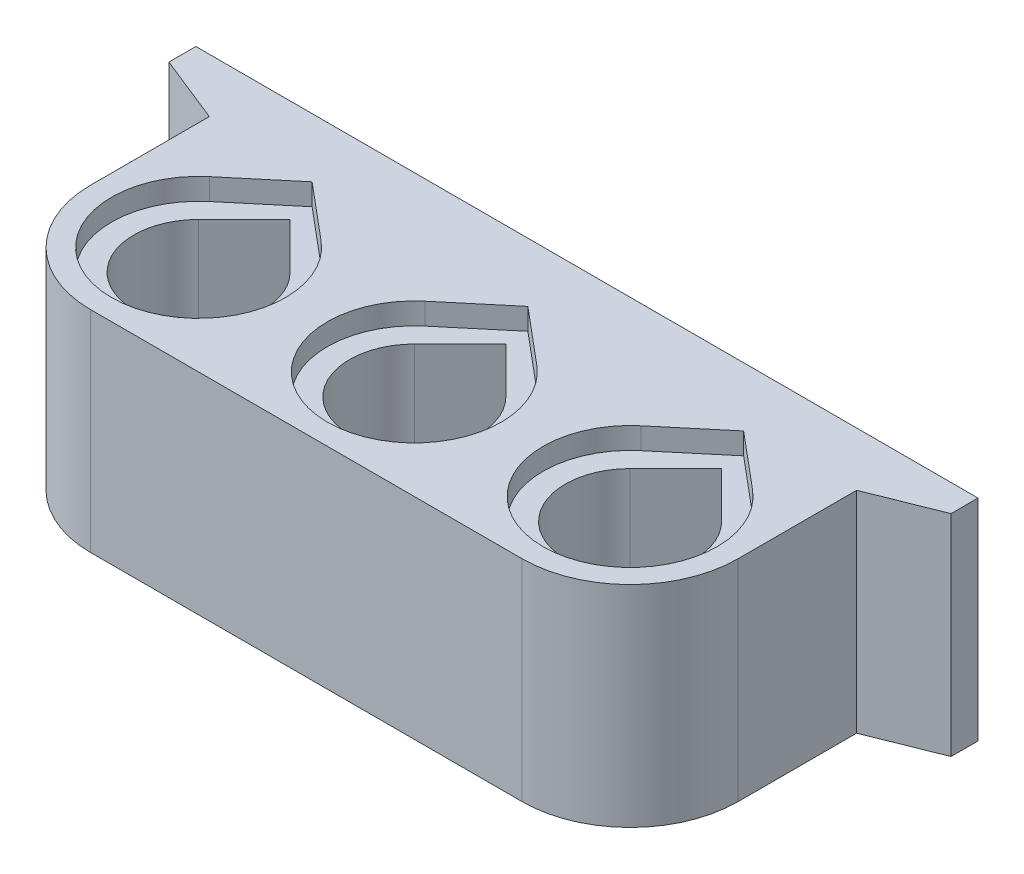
ISO-10303-21;
HEADER;
FILE_DESCRIPTION(('STEP AP214'),'2;1');
FILE_NAME('part.step','',(''),(''),'','','');
FILE_SCHEMA(('AUTOMOTIVE_DESIGN { 1 0 10303 214 1 1 1 1 }'));
ENDSEC;
DATA;
#1=APPLICATION_CONTEXT('core data for automotive mechanical design processes');
#2=APPLICATION_PROTOCOL_DEFINITION('international standard','automotive_design',2000,#1);
#3=PRODUCT_CONTEXT('',#1,'mechanical');
#4=PRODUCT('Part','Part','',(#3));
#5=PRODUCT_RELATED_PRODUCT_CATEGORY('part','',(#4));
#6=PRODUCT_DEFINITION_FORMATION('','',#4);
#7=PRODUCT_DEFINITION_CONTEXT('part definition',#1,'design');
#8=PRODUCT_DEFINITION('design','',#6,#7);
#9=PRODUCT_DEFINITION_SHAPE('','',#8);
#10=(LENGTH_UNIT() NAMED_UNIT(*) SI_UNIT(.MILLI.,.METRE.));
#11=(NAMED_UNIT(*) PLANE_ANGLE_UNIT() SI_UNIT($,.RADIAN.));
#12=(NAMED_UNIT(*) SI_UNIT($,.STERADIAN.) SOLID_ANGLE_UNIT());
#13=UNCERTAINTY_MEASURE_WITH_UNIT(LENGTH_MEASURE(1.E-05),#10,'distance_accuracy_value','');
#14=(GEOMETRIC_REPRESENTATION_CONTEXT(3) GLOBAL_UNCERTAINTY_ASSIGNED_CONTEXT((#13)) GLOBAL_UNIT_ASSIGNED_CONTEXT((#10,
#11,#12)) REPRESENTATION_CONTEXT('',''));
#15=CARTESIAN_POINT('',(0.,0.,0.));
#16=DIRECTION('',(0.,0.,1.));
#17=DIRECTION('',(1.,0.,0.));
#18=AXIS2_PLACEMENT_3D('',#15,#16,#17);
#19=CARTESIAN_POINT('',(4.,7.8,-7.39411254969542));
#20=DIRECTION('',(0.707106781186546,0.,0.707106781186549));
#21=DIRECTION('',(0.707106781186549,0.,-0.707106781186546));
#22=AXIS2_PLACEMENT_3D('',#19,#20,#21);
#23=PLANE('',#22);
#24=DIRECTION('',(0.,-1.,0.));
#25=VECTOR('',#24,1.);
#26=CARTESIAN_POINT('',(2.30294372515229,7.8,-5.69705627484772));
#27=LINE('',#26,#25);
#28=CARTESIAN_POINT('',(2.30294372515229,7.,-5.69705627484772));
#29=VERTEX_POINT('',#28);
#30=CARTESIAN_POINT('',(2.30294372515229,0.8,-5.69705627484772));
#31=VERTEX_POINT('',#30);
#32=EDGE_CURVE('E493',#29,#31,#27,.T.);
#33=ORIENTED_EDGE('',*,*,#32,.T.);
#34=DIRECTION('',(0.707106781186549,0.,-0.707106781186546));
#35=VECTOR('',#34,1.);
#36=CARTESIAN_POINT('',(4.,0.8,-7.39411254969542));
#37=LINE('',#36,#35);
#38=CARTESIAN_POINT('',(4.,0.8,-7.39411254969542));
#39=VERTEX_POINT('',#38);
#40=EDGE_CURVE('E376',#31,#39,#37,.T.);
#41=ORIENTED_EDGE('',*,*,#40,.T.);
#42=DIRECTION('',(0.,-1.,0.));
#43=VECTOR('',#42,1.);
#44=CARTESIAN_POINT('',(4.,7.8,-7.39411254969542));
#45=LINE('',#44,#43);
#46=CARTESIAN_POINT('',(4.,7.,-7.39411254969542));
#47=VERTEX_POINT('',#46);
#48=EDGE_CURVE('E487',#47,#39,#45,.T.);
#49=ORIENTED_EDGE('',*,*,#48,.F.);
#50=DIRECTION('',(-0.707106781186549,0.,0.707106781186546));
#51=VECTOR('',#50,1.);
#52=CARTESIAN_POINT('',(4.,7.,-7.39411254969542));
#53=LINE('',#52,#51);
#54=EDGE_CURVE('E466',#47,#29,#53,.T.);
#55=ORIENTED_EDGE('',*,*,#54,.T.);
#56=EDGE_LOOP('',(#33,#41,#49,#55));
#57=FACE_BOUND('',#56,.T.);
#58=ADVANCED_FACE('F37',(#57),#23,.T.);
#59=CARTESIAN_POINT('',(4.,7.8,-4.));
#60=DIRECTION('',(0.,-1.,0.));
#61=DIRECTION('',(0.,0.,-1.));
#62=AXIS2_PLACEMENT_3D('',#59,#60,#61);
#63=CYLINDRICAL_SURFACE('',#62,2.4);
#64=DIRECTION('',(0.,-1.,0.));
#65=VECTOR('',#64,1.);
#66=CARTESIAN_POINT('',(5.69705627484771,7.8,-5.69705627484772));
#67=LINE('',#66,#65);
#68=CARTESIAN_POINT('',(5.69705627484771,7.,-5.69705627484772));
#69=VERTEX_POINT('',#68);
#70=CARTESIAN_POINT('',(5.69705627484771,0.8,-5.69705627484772));
#71=VERTEX_POINT('',#70);
#72=EDGE_CURVE('E490',#69,#71,#67,.T.);
#73=ORIENTED_EDGE('',*,*,#72,.T.);
#74=CARTESIAN_POINT('',(4.,0.8,-4.));
#75=DIRECTION('',(0.,-1.,0.));
#76=DIRECTION('',(0.,0.,-1.));
#77=AXIS2_PLACEMENT_3D('',#74,#75,#76);
#78=CIRCLE('',#77,2.4);
#79=EDGE_CURVE('E373',#71,#31,#78,.T.);
#80=ORIENTED_EDGE('',*,*,#79,.T.);
#81=ORIENTED_EDGE('',*,*,#32,.F.);
#82=CARTESIAN_POINT('',(4.,7.,-4.));
#83=DIRECTION('',(0.,1.,0.));
#84=DIRECTION('',(0.,0.,1.));
#85=AXIS2_PLACEMENT_3D('',#82,#83,#84);
#86=CIRCLE('',#85,2.4);
#87=EDGE_CURVE('E463',#29,#69,#86,.T.);
#88=ORIENTED_EDGE('',*,*,#87,.T.);
#89=EDGE_LOOP('',(#73,#80,#81,#88));
#90=FACE_BOUND('',#89,.T.);
#91=ADVANCED_FACE('F625',(#90),#63,.F.);
#92=CARTESIAN_POINT('',(4.,7.8,-7.39411254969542));
#93=DIRECTION('',(-0.707106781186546,0.,0.707106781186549));
#94=DIRECTION('',(0.707106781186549,0.,0.707106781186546));
#95=AXIS2_PLACEMENT_3D('',#92,#93,#94);
#96=PLANE('',#95);
#97=ORIENTED_EDGE('',*,*,#48,.T.);
#98=DIRECTION('',(0.707106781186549,0.,0.707106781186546));
#99=VECTOR('',#98,1.);
#100=CARTESIAN_POINT('',(4.,0.8,-7.39411254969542));
#101=LINE('',#100,#99);
#102=EDGE_CURVE('E563',#39,#71,#101,.T.);
#103=ORIENTED_EDGE('',*,*,#102,.T.);
#104=ORIENTED_EDGE('',*,*,#72,.F.);
#105=DIRECTION('',(-0.707106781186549,0.,-0.707106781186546));
#106=VECTOR('',#105,1.);
#107=CARTESIAN_POINT('',(4.,7.,-7.39411254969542));
#108=LINE('',#107,#106);
#109=EDGE_CURVE('E554',#69,#47,#108,.T.);
#110=ORIENTED_EDGE('',*,*,#109,.T.);
#111=EDGE_LOOP('',(#97,#103,#104,#110));
#112=FACE_BOUND('',#111,.T.);
#113=ADVANCED_FACE('F631',(#112),#96,.T.);
#114=CARTESIAN_POINT('',(12.,7.8,-7.39411254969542));
#115=DIRECTION('',(0.707106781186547,0.,0.707106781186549));
#116=DIRECTION('',(0.707106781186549,0.,-0.707106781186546));
#117=AXIS2_PLACEMENT_3D('',#114,#115,#116);
#118=PLANE('',#117);
#119=DIRECTION('',(0.,-1.,0.));
#120=VECTOR('',#119,1.);
#121=CARTESIAN_POINT('',(10.3029437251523,7.8,-5.69705627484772));
#122=LINE('',#121,#120);
#123=CARTESIAN_POINT('',(10.3029437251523,7.,-5.69705627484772));
#124=VERTEX_POINT('',#123);
#125=CARTESIAN_POINT('',(10.3029437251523,0.8,-5.69705627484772));
#126=VERTEX_POINT('',#125);
#127=EDGE_CURVE('E484',#124,#126,#122,.T.);
#128=ORIENTED_EDGE('',*,*,#127,.T.);
#129=DIRECTION('',(0.707106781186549,0.,-0.707106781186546));
#130=VECTOR('',#129,1.);
#131=CARTESIAN_POINT('',(12.,0.8,-7.39411254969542));
#132=LINE('',#131,#130);
#133=CARTESIAN_POINT('',(12.,0.8,-7.39411254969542));
#134=VERTEX_POINT('',#133);
#135=EDGE_CURVE('E370',#126,#134,#132,.T.);
#136=ORIENTED_EDGE('',*,*,#135,.T.);
#137=DIRECTION('',(0.,-1.,0.));
#138=VECTOR('',#137,1.);
#139=CARTESIAN_POINT('',(12.,7.8,-7.39411254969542));
#140=LINE('',#139,#138);
#141=CARTESIAN_POINT('',(12.,7.,-7.39411254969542));
#142=VERTEX_POINT('',#141);
#143=EDGE_CURVE('E478',#142,#134,#140,.T.);
#144=ORIENTED_EDGE('',*,*,#143,.F.);
#145=DIRECTION('',(-0.707106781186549,0.,0.707106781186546));
#146=VECTOR('',#145,1.);
#147=CARTESIAN_POINT('',(12.,7.,-7.39411254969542));
#148=LINE('',#147,#146);
#149=EDGE_CURVE('E460',#142,#124,#148,.T.);
#150=ORIENTED_EDGE('',*,*,#149,.T.);
#151=EDGE_LOOP('',(#128,#136,#144,#150));
#152=FACE_BOUND('',#151,.T.);
#153=ADVANCED_FACE('F959',(#152),#118,.T.);
#154=CARTESIAN_POINT('',(12.,7.8,-4.));
#155=DIRECTION('',(0.,-1.,0.));
#156=DIRECTION('',(0.,0.,-1.));
#157=AXIS2_PLACEMENT_3D('',#154,#155,#156);
#158=CYLINDRICAL_SURFACE('',#157,2.4);
#159=DIRECTION('',(0.,-1.,0.));
#160=VECTOR('',#159,1.);
#161=CARTESIAN_POINT('',(13.6970562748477,7.8,-5.69705627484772));
#162=LINE('',#161,#160);
#163=CARTESIAN_POINT('',(13.6970562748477,7.,-5.69705627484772));
#164=VERTEX_POINT('',#163);
#165=CARTESIAN_POINT('',(13.6970562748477,0.8,-5.69705627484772));
#166=VERTEX_POINT('',#165);
#167=EDGE_CURVE('E481',#164,#166,#162,.T.);
#168=ORIENTED_EDGE('',*,*,#167,.T.);
#169=CARTESIAN_POINT('',(12.,0.8,-4.));
#170=DIRECTION('',(0.,-1.,0.));
#171=DIRECTION('',(0.,0.,-1.));
#172=AXIS2_PLACEMENT_3D('',#169,#170,#171);
#173=CIRCLE('',#172,2.4);
#174=EDGE_CURVE('E367',#166,#126,#173,.T.);
#175=ORIENTED_EDGE('',*,*,#174,.T.);
#176=ORIENTED_EDGE('',*,*,#127,.F.);
#177=CARTESIAN_POINT('',(12.,7.,-4.));
#178=DIRECTION('',(0.,1.,0.));
#179=DIRECTION('',(0.,0.,1.));
#180=AXIS2_PLACEMENT_3D('',#177,#178,#179);
#181=CIRCLE('',#180,2.4);
#182=EDGE_CURVE('E457',#124,#164,#181,.T.);
#183=ORIENTED_EDGE('',*,*,#182,.T.);
#184=EDGE_LOOP('',(#168,#175,#176,#183));
#185=FACE_BOUND('',#184,.T.);
#186=ADVANCED_FACE('F968',(#185),#158,.F.);
#187=CARTESIAN_POINT('',(12.,7.8,-7.39411254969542));
#188=DIRECTION('',(-0.707106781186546,0.,0.707106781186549));
#189=DIRECTION('',(0.707106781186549,0.,0.707106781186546));
#190=AXIS2_PLACEMENT_3D('',#187,#188,#189);
#191=PLANE('',#190);
#192=ORIENTED_EDGE('',*,*,#143,.T.);
#193=DIRECTION('',(0.707106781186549,0.,0.707106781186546));
#194=VECTOR('',#193,1.);
#195=CARTESIAN_POINT('',(12.,0.8,-7.39411254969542));
#196=LINE('',#195,#194);
#197=EDGE_CURVE('E560',#134,#166,#196,.T.);
#198=ORIENTED_EDGE('',*,*,#197,.T.);
#199=ORIENTED_EDGE('',*,*,#167,.F.);
#200=DIRECTION('',(-0.707106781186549,0.,-0.707106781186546));
#201=VECTOR('',#200,1.);
#202=CARTESIAN_POINT('',(12.,7.,-7.39411254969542));
#203=LINE('',#202,#201);
#204=EDGE_CURVE('E551',#164,#142,#203,.T.);
#205=ORIENTED_EDGE('',*,*,#204,.T.);
#206=EDGE_LOOP('',(#192,#198,#199,#205));
#207=FACE_BOUND('',#206,.T.);
#208=ADVANCED_FACE('F978',(#207),#191,.T.);
#209=CARTESIAN_POINT('',(20.,7.8,-7.39411254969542));
#210=DIRECTION('',(0.707106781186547,0.,0.707106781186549));
#211=DIRECTION('',(0.707106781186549,0.,-0.707106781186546));
#212=AXIS2_PLACEMENT_3D('',#209,#210,#211);
#213=PLANE('',#212);
#214=DIRECTION('',(0.,-1.,0.));
#215=VECTOR('',#214,1.);
#216=CARTESIAN_POINT('',(18.3029437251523,7.8,-5.69705627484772));
#217=LINE('',#216,#215);
#218=CARTESIAN_POINT('',(18.3029437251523,7.,-5.69705627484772));
#219=VERTEX_POINT('',#218);
#220=CARTESIAN_POINT('',(18.3029437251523,0.8,-5.69705627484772));
#221=VERTEX_POINT('',#220);
#222=EDGE_CURVE('E475',#219,#221,#217,.T.);
#223=ORIENTED_EDGE('',*,*,#222,.T.);
#224=DIRECTION('',(0.707106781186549,0.,-0.707106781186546));
#225=VECTOR('',#224,1.);
#226=CARTESIAN_POINT('',(20.,0.8,-7.39411254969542));
#227=LINE('',#226,#225);
#228=CARTESIAN_POINT('',(20.,0.8,-7.39411254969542));
#229=VERTEX_POINT('',#228);
#230=EDGE_CURVE('E364',#221,#229,#227,.T.);
#231=ORIENTED_EDGE('',*,*,#230,.T.);
#232=DIRECTION('',(0.,-1.,0.));
#233=VECTOR('',#232,1.);
#234=CARTESIAN_POINT('',(20.,7.8,-7.39411254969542));
#235=LINE('',#234,#233);
#236=CARTESIAN_POINT('',(20.,7.,-7.39411254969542));
#237=VERTEX_POINT('',#236);
#238=EDGE_CURVE('E469',#237,#229,#235,.T.);
#239=ORIENTED_EDGE('',*,*,#238,.F.);
#240=DIRECTION('',(-0.707106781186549,0.,0.707106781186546));
#241=VECTOR('',#240,1.);
#242=CARTESIAN_POINT('',(20.,7.,-7.39411254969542));
#243=LINE('',#242,#241);
#244=EDGE_CURVE('E454',#237,#219,#243,.T.);
#245=ORIENTED_EDGE('',*,*,#244,.T.);
#246=EDGE_LOOP('',(#223,#231,#239,#245));
#247=FACE_BOUND('',#246,.T.);
#248=ADVANCED_FACE('F988',(#247),#213,.T.);
#249=CARTESIAN_POINT('',(20.,7.8,-4.));
#250=DIRECTION('',(0.,-1.,0.));
#251=DIRECTION('',(0.,0.,-1.));
#252=AXIS2_PLACEMENT_3D('',#249,#250,#251);
#253=CYLINDRICAL_SURFACE('',#252,2.4);
#254=DIRECTION('',(0.,-1.,0.));
#255=VECTOR('',#254,1.);
#256=CARTESIAN_POINT('',(21.6970562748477,7.8,-5.69705627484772));
#257=LINE('',#256,#255);
#258=CARTESIAN_POINT('',(21.6970562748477,7.,-5.69705627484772));
#259=VERTEX_POINT('',#258);
#260=CARTESIAN_POINT('',(21.6970562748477,0.8,-5.69705627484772));
#261=VERTEX_POINT('',#260);
#262=EDGE_CURVE('E472',#259,#261,#257,.T.);
#263=ORIENTED_EDGE('',*,*,#262,.T.);
#264=CARTESIAN_POINT('',(20.,0.8,-4.));
#265=DIRECTION('',(0.,-1.,0.));
#266=DIRECTION('',(0.,0.,-1.));
#267=AXIS2_PLACEMENT_3D('',#264,#265,#266);
#268=CIRCLE('',#267,2.4);
#269=EDGE_CURVE('E313',#261,#221,#268,.T.);
#270=ORIENTED_EDGE('',*,*,#269,.T.);
#271=ORIENTED_EDGE('',*,*,#222,.F.);
#272=CARTESIAN_POINT('',(20.,7.,-4.));
#273=DIRECTION('',(0.,1.,0.));
#274=DIRECTION('',(0.,0.,1.));
#275=AXIS2_PLACEMENT_3D('',#272,#273,#274);
#276=CIRCLE('',#275,2.4);
#277=EDGE_CURVE('E401',#219,#259,#276,.T.);
#278=ORIENTED_EDGE('',*,*,#277,.T.);
#279=EDGE_LOOP('',(#263,#270,#271,#278));
#280=FACE_BOUND('',#279,.T.);
#281=ADVANCED_FACE('F998',(#280),#253,.F.);
#282=CARTESIAN_POINT('',(20.,7.8,-7.39411254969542));
#283=DIRECTION('',(-0.707106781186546,0.,0.707106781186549));
#284=DIRECTION('',(0.707106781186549,0.,0.707106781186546));
#285=AXIS2_PLACEMENT_3D('',#282,#283,#284);
#286=PLANE('',#285);
#287=ORIENTED_EDGE('',*,*,#238,.T.);
#288=DIRECTION('',(0.707106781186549,0.,0.707106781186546));
#289=VECTOR('',#288,1.);
#290=CARTESIAN_POINT('',(20.,0.8,-7.39411254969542));
#291=LINE('',#290,#289);
#292=EDGE_CURVE('E557',#229,#261,#291,.T.);
#293=ORIENTED_EDGE('',*,*,#292,.T.);
#294=ORIENTED_EDGE('',*,*,#262,.F.);
#295=DIRECTION('',(-0.707106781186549,0.,-0.707106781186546));
#296=VECTOR('',#295,1.);
#297=CARTESIAN_POINT('',(20.,7.,-7.39411254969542));
#298=LINE('',#297,#296);
#299=EDGE_CURVE('E548',#259,#237,#298,.T.);
#300=ORIENTED_EDGE('',*,*,#299,.T.);
#301=EDGE_LOOP('',(#287,#293,#294,#300));
#302=FACE_BOUND('',#301,.T.);
#303=ADVANCED_FACE('F638',(#302),#286,.T.);
#304=CARTESIAN_POINT('',(0.,7.8,0.));
#305=DIRECTION('',(0.,1.,0.));
#306=DIRECTION('',(0.,0.,1.));
#307=AXIS2_PLACEMENT_3D('',#304,#305,#306);
#308=PLANE('',#307);
#309=DIRECTION('',(-0.766044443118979,0.,-0.642787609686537));
#310=VECTOR('',#309,1.);
#311=CARTESIAN_POINT('',(4.,7.8,-8.20993850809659));
#312=LINE('',#311,#310);
#313=CARTESIAN_POINT('',(6.07299004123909,7.8,-6.47049332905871));
#314=VERTEX_POINT('',#313);
#315=CARTESIAN_POINT('',(4.,7.8,-8.20993850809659));
#316=VERTEX_POINT('',#315);
#317=EDGE_CURVE('E391',#314,#316,#312,.T.);
#318=ORIENTED_EDGE('',*,*,#317,.F.);
#319=CARTESIAN_POINT('',(4.,7.8,-4.));
#320=DIRECTION('',(0.,1.,0.));
#321=DIRECTION('',(0.,0.,1.));
#322=AXIS2_PLACEMENT_3D('',#319,#320,#321);
#323=CIRCLE('',#322,3.225);
#324=CARTESIAN_POINT('',(1.92700995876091,7.8,-6.47049332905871));
#325=VERTEX_POINT('',#324);
#326=EDGE_CURVE('E384',#325,#314,#323,.T.);
#327=ORIENTED_EDGE('',*,*,#326,.F.);
#328=DIRECTION('',(-0.76604444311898,0.,0.642787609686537));
#329=VECTOR('',#328,1.);
#330=CARTESIAN_POINT('',(4.,7.8,-8.20993850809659));
#331=LINE('',#330,#329);
#332=EDGE_CURVE('E393',#316,#325,#331,.T.);
#333=ORIENTED_EDGE('',*,*,#332,.F.);
#334=EDGE_LOOP('',(#318,#327,#333));
#335=FACE_BOUND('',#334,.T.);
#336=DIRECTION('',(-0.766044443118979,0.,-0.642787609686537));
#337=VECTOR('',#336,1.);
#338=CARTESIAN_POINT('',(12.,7.8,-8.20993850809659));
#339=LINE('',#338,#337);
#340=CARTESIAN_POINT('',(14.0729900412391,7.8,-6.47049332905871));
#341=VERTEX_POINT('',#340);
#342=CARTESIAN_POINT('',(12.,7.8,-8.20993850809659));
#343=VERTEX_POINT('',#342);
#344=EDGE_CURVE('E394',#341,#343,#339,.T.);
#345=ORIENTED_EDGE('',*,*,#344,.F.);
#346=CARTESIAN_POINT('',(12.,7.8,-4.));
#347=DIRECTION('',(0.,1.,0.));
#348=DIRECTION('',(0.,0.,1.));
#349=AXIS2_PLACEMENT_3D('',#346,#347,#348);
#350=CIRCLE('',#349,3.225);
#351=CARTESIAN_POINT('',(9.92700995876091,7.8,-6.47049332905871));
#352=VERTEX_POINT('',#351);
#353=EDGE_CURVE('E415',#352,#341,#350,.T.);
#354=ORIENTED_EDGE('',*,*,#353,.F.);
#355=DIRECTION('',(-0.76604444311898,0.,0.642787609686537));
#356=VECTOR('',#355,1.);
#357=CARTESIAN_POINT('',(12.,7.8,-8.20993850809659));
#358=LINE('',#357,#356);
#359=EDGE_CURVE('E418',#343,#352,#358,.T.);
#360=ORIENTED_EDGE('',*,*,#359,.F.);
#361=EDGE_LOOP('',(#345,#354,#360));
#362=FACE_BOUND('',#361,.T.);
#363=DIRECTION('',(-0.766044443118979,0.,-0.642787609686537));
#364=VECTOR('',#363,1.);
#365=CARTESIAN_POINT('',(20.,7.8,-8.20993850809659));
#366=LINE('',#365,#364);
#367=CARTESIAN_POINT('',(22.0729900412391,7.8,-6.47049332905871));
#368=VERTEX_POINT('',#367);
#369=CARTESIAN_POINT('',(20.,7.8,-8.2099385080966));
#370=VERTEX_POINT('',#369);
#371=EDGE_CURVE('E414',#368,#370,#366,.T.);
#372=ORIENTED_EDGE('',*,*,#371,.F.);
#373=CARTESIAN_POINT('',(20.,7.8,-4.));
#374=DIRECTION('',(0.,1.,0.));
#375=DIRECTION('',(0.,0.,1.));
#376=AXIS2_PLACEMENT_3D('',#373,#374,#375);
#377=CIRCLE('',#376,3.225);
#378=CARTESIAN_POINT('',(17.9270099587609,7.8,-6.47049332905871));
#379=VERTEX_POINT('',#378);
#380=EDGE_CURVE('E437',#379,#368,#377,.T.);
#381=ORIENTED_EDGE('',*,*,#380,.F.);
#382=DIRECTION('',(-0.76604444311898,0.,0.642787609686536));
#383=VECTOR('',#382,1.);
#384=CARTESIAN_POINT('',(20.,7.8,-8.20993850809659));
#385=LINE('',#384,#383);
#386=EDGE_CURVE('E440',#370,#379,#385,.T.);
#387=ORIENTED_EDGE('',*,*,#386,.F.);
#388=EDGE_LOOP('',(#372,#381,#387));
#389=FACE_BOUND('',#388,.T.);
#390=DIRECTION('',(0.,0.,1.));
#391=VECTOR('',#390,1.);
#392=CARTESIAN_POINT('',(0.,7.8,0.));
#393=LINE('',#392,#391);
#394=CARTESIAN_POINT('',(0.,7.8,-8.4));
#395=VERTEX_POINT('',#394);
#396=CARTESIAN_POINT('',(0.,7.8,-4.));
#397=VERTEX_POINT('',#396);
#398=EDGE_CURVE('E497',#395,#397,#393,.T.);
#399=ORIENTED_EDGE('',*,*,#398,.T.);
#400=CARTESIAN_POINT('',(4.,7.8,-4.));
#401=DIRECTION('',(0.,1.,0.));
#402=DIRECTION('',(0.,0.,1.));
#403=AXIS2_PLACEMENT_3D('',#400,#401,#402);
#404=CIRCLE('',#403,4.);
#405=CARTESIAN_POINT('',(4.,7.8,0.));
#406=VERTEX_POINT('',#405);
#407=EDGE_CURVE('E45',#397,#406,#404,.T.);
#408=ORIENTED_EDGE('',*,*,#407,.T.);
#409=DIRECTION('',(1.,0.,0.));
#410=VECTOR('',#409,1.);
#411=CARTESIAN_POINT('',(0.,7.8,0.));
#412=LINE('',#411,#410);
#413=CARTESIAN_POINT('',(20.,7.8,0.));
#414=VERTEX_POINT('',#413);
#415=EDGE_CURVE('E499',#406,#414,#412,.T.);
#416=ORIENTED_EDGE('',*,*,#415,.T.);
#417=CARTESIAN_POINT('',(20.,7.8,-4.));
#418=DIRECTION('',(0.,1.,0.));
#419=DIRECTION('',(0.,0.,1.));
#420=AXIS2_PLACEMENT_3D('',#417,#418,#419);
#421=CIRCLE('',#420,4.);
#422=CARTESIAN_POINT('',(24.,7.8,-4.));
#423=VERTEX_POINT('',#422);
#424=EDGE_CURVE('E52',#414,#423,#421,.T.);
#425=ORIENTED_EDGE('',*,*,#424,.T.);
#426=DIRECTION('',(0.,0.,-1.));
#427=VECTOR('',#426,1.);
#428=CARTESIAN_POINT('',(24.,7.8,0.));
#429=LINE('',#428,#427);
#430=CARTESIAN_POINT('',(24.,7.8,-8.4));
#431=VERTEX_POINT('',#430);
#432=EDGE_CURVE('E502',#423,#431,#429,.T.);
#433=ORIENTED_EDGE('',*,*,#432,.T.);
#434=DIRECTION('',(0.92847669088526,0.,-0.371390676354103));
#435=VECTOR('',#434,1.);
#436=CARTESIAN_POINT('',(26.5,7.8,-9.4));
#437=LINE('',#436,#435);
#438=CARTESIAN_POINT('',(26.5,7.8,-9.4));
#439=VERTEX_POINT('',#438);
#440=EDGE_CURVE('E504',#431,#439,#437,.T.);
#441=ORIENTED_EDGE('',*,*,#440,.T.);
#442=DIRECTION('',(0.,0.,-1.));
#443=VECTOR('',#442,1.);
#444=CARTESIAN_POINT('',(26.5,7.8,-10.4));
#445=LINE('',#444,#443);
#446=CARTESIAN_POINT('',(26.5,7.8,-10.4));
#447=VERTEX_POINT('',#446);
#448=EDGE_CURVE('E506',#439,#447,#445,.T.);
#449=ORIENTED_EDGE('',*,*,#448,.T.);
#450=DIRECTION('',(-1.,0.,0.));
#451=VECTOR('',#450,1.);
#452=CARTESIAN_POINT('',(24.,7.8,-10.4));
#453=LINE('',#452,#451);
#454=CARTESIAN_POINT('',(-2.5,7.8,-10.4));
#455=VERTEX_POINT('',#454);
#456=EDGE_CURVE('E508',#447,#455,#453,.T.);
#457=ORIENTED_EDGE('',*,*,#456,.T.);
#458=DIRECTION('',(0.,0.,1.));
#459=VECTOR('',#458,1.);
#460=CARTESIAN_POINT('',(-2.5,7.8,-10.4));
#461=LINE('',#460,#459);
#462=CARTESIAN_POINT('',(-2.5,7.8,-9.4));
#463=VERTEX_POINT('',#462);
#464=EDGE_CURVE('E510',#455,#463,#461,.T.);
#465=ORIENTED_EDGE('',*,*,#464,.T.);
#466=DIRECTION('',(0.928476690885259,0.,0.371390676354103));
#467=VECTOR('',#466,1.);
#468=CARTESIAN_POINT('',(-2.5,7.8,-9.4));
#469=LINE('',#468,#467);
#470=EDGE_CURVE('E512',#463,#395,#469,.T.);
#471=ORIENTED_EDGE('',*,*,#470,.T.);
#472=EDGE_LOOP('',(#399,#408,#416,#425,#433,#441,#449,#457,#465,#471));
#473=FACE_BOUND('',#472,.T.);
#474=ADVANCED_FACE('F578',(#335,#362,#389,#473),#308,.T.);
#475=CARTESIAN_POINT('',(0.,0.,0.));
#476=DIRECTION('',(0.,1.,0.));
#477=DIRECTION('',(0.,0.,1.));
#478=AXIS2_PLACEMENT_3D('',#475,#476,#477);
#479=PLANE('',#478);
#480=DIRECTION('',(-0.766044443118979,0.,-0.642787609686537));
#481=VECTOR('',#480,1.);
#482=CARTESIAN_POINT('',(4.,0.,-8.20993850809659));
#483=LINE('',#482,#481);
#484=CARTESIAN_POINT('',(6.07299004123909,0.,-6.47049332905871));
#485=VERTEX_POINT('',#484);
#486=CARTESIAN_POINT('',(4.,0.,-8.20993850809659));
#487=VERTEX_POINT('',#486);
#488=EDGE_CURVE('E298',#485,#487,#483,.T.);
#489=ORIENTED_EDGE('',*,*,#488,.T.);
#490=DIRECTION('',(-0.76604444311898,0.,0.642787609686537));
#491=VECTOR('',#490,1.);
#492=CARTESIAN_POINT('',(4.,0.,-8.20993850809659));
#493=LINE('',#492,#491);
#494=CARTESIAN_POINT('',(1.92700995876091,0.,-6.47049332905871));
#495=VERTEX_POINT('',#494);
#496=EDGE_CURVE('E301',#487,#495,#493,.T.);
#497=ORIENTED_EDGE('',*,*,#496,.T.);
#498=CARTESIAN_POINT('',(4.,0.,-4.));
#499=DIRECTION('',(0.,1.,0.));
#500=DIRECTION('',(0.,0.,1.));
#501=AXIS2_PLACEMENT_3D('',#498,#499,#500);
#502=CIRCLE('',#501,3.225);
#503=EDGE_CURVE('E304',#495,#485,#502,.T.);
#504=ORIENTED_EDGE('',*,*,#503,.T.);
#505=EDGE_LOOP('',(#489,#497,#504));
#506=FACE_BOUND('',#505,.T.);
#507=DIRECTION('',(-0.766044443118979,0.,-0.642787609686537));
#508=VECTOR('',#507,1.);
#509=CARTESIAN_POINT('',(12.,0.,-8.20993850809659));
#510=LINE('',#509,#508);
#511=CARTESIAN_POINT('',(14.0729900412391,0.,-6.47049332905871));
#512=VERTEX_POINT('',#511);
#513=CARTESIAN_POINT('',(12.,0.,-8.20993850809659));
#514=VERTEX_POINT('',#513);
#515=EDGE_CURVE('E324',#512,#514,#510,.T.);
#516=ORIENTED_EDGE('',*,*,#515,.T.);
#517=DIRECTION('',(-0.76604444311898,0.,0.642787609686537));
#518=VECTOR('',#517,1.);
#519=CARTESIAN_POINT('',(12.,0.,-8.20993850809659));
#520=LINE('',#519,#518);
#521=CARTESIAN_POINT('',(9.92700995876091,0.,-6.47049332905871));
#522=VERTEX_POINT('',#521);
#523=EDGE_CURVE('E319',#514,#522,#520,.T.);
#524=ORIENTED_EDGE('',*,*,#523,.T.);
#525=CARTESIAN_POINT('',(12.,0.,-4.));
#526=DIRECTION('',(0.,1.,0.));
#527=DIRECTION('',(0.,0.,1.));
#528=AXIS2_PLACEMENT_3D('',#525,#526,#527);
#529=CIRCLE('',#528,3.225);
#530=EDGE_CURVE('E327',#522,#512,#529,.T.);
#531=ORIENTED_EDGE('',*,*,#530,.T.);
#532=EDGE_LOOP('',(#516,#524,#531));
#533=FACE_BOUND('',#532,.T.);
#534=DIRECTION('',(-0.766044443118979,0.,-0.642787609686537));
#535=VECTOR('',#534,1.);
#536=CARTESIAN_POINT('',(20.,0.,-8.20993850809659));
#537=LINE('',#536,#535);
#538=CARTESIAN_POINT('',(22.0729900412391,0.,-6.47049332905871));
#539=VERTEX_POINT('',#538);
#540=CARTESIAN_POINT('',(20.,0.,-8.20993850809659));
#541=VERTEX_POINT('',#540);
#542=EDGE_CURVE('E348',#539,#541,#537,.T.);
#543=ORIENTED_EDGE('',*,*,#542,.T.);
#544=DIRECTION('',(-0.76604444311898,0.,0.642787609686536));
#545=VECTOR('',#544,1.);
#546=CARTESIAN_POINT('',(20.,0.,-8.20993850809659));
#547=LINE('',#546,#545);
#548=CARTESIAN_POINT('',(17.9270099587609,0.,-6.47049332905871));
#549=VERTEX_POINT('',#548);
#550=EDGE_CURVE('E343',#541,#549,#547,.T.);
#551=ORIENTED_EDGE('',*,*,#550,.T.);
#552=CARTESIAN_POINT('',(20.,0.,-4.));
#553=DIRECTION('',(0.,1.,0.));
#554=DIRECTION('',(0.,0.,1.));
#555=AXIS2_PLACEMENT_3D('',#552,#553,#554);
#556=CIRCLE('',#555,3.225);
#557=EDGE_CURVE('E351',#549,#539,#556,.T.);
#558=ORIENTED_EDGE('',*,*,#557,.T.);
#559=EDGE_LOOP('',(#543,#551,#558));
#560=FACE_BOUND('',#559,.T.);
#561=DIRECTION('',(1.,0.,0.));
#562=VECTOR('',#561,1.);
#563=CARTESIAN_POINT('',(0.,0.,0.));
#564=LINE('',#563,#562);
#565=CARTESIAN_POINT('',(4.,0.,0.));
#566=VERTEX_POINT('',#565);
#567=CARTESIAN_POINT('',(20.,0.,0.));
#568=VERTEX_POINT('',#567);
#569=EDGE_CURVE('E516',#566,#568,#564,.T.);
#570=ORIENTED_EDGE('',*,*,#569,.F.);
#571=CARTESIAN_POINT('',(4.,0.,-4.));
#572=DIRECTION('',(0.,1.,0.));
#573=DIRECTION('',(0.,0.,1.));
#574=AXIS2_PLACEMENT_3D('',#571,#572,#573);
#575=CIRCLE('',#574,4.);
#576=CARTESIAN_POINT('',(0.,0.,-4.));
#577=VERTEX_POINT('',#576);
#578=EDGE_CURVE('E573',#566,#577,#575,.F.);
#579=ORIENTED_EDGE('',*,*,#578,.T.);
#580=DIRECTION('',(0.,0.,1.));
#581=VECTOR('',#580,1.);
#582=CARTESIAN_POINT('',(0.,0.,0.));
#583=LINE('',#582,#581);
#584=CARTESIAN_POINT('',(0.,0.,-8.4));
#585=VERTEX_POINT('',#584);
#586=EDGE_CURVE('E496',#585,#577,#583,.T.);
#587=ORIENTED_EDGE('',*,*,#586,.F.);
#588=DIRECTION('',(0.928476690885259,0.,0.371390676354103));
#589=VECTOR('',#588,1.);
#590=CARTESIAN_POINT('',(-2.5,0.,-9.4));
#591=LINE('',#590,#589);
#592=CARTESIAN_POINT('',(-2.5,0.,-9.4));
#593=VERTEX_POINT('',#592);
#594=EDGE_CURVE('E500',#593,#585,#591,.T.);
#595=ORIENTED_EDGE('',*,*,#594,.F.);
#596=DIRECTION('',(0.,0.,1.));
#597=VECTOR('',#596,1.);
#598=CARTESIAN_POINT('',(-2.5,0.,-10.4));
#599=LINE('',#598,#597);
#600=CARTESIAN_POINT('',(-2.5,0.,-10.4));
#601=VERTEX_POINT('',#600);
#602=EDGE_CURVE('E528',#601,#593,#599,.T.);
#603=ORIENTED_EDGE('',*,*,#602,.F.);
#604=DIRECTION('',(-1.,0.,0.));
#605=VECTOR('',#604,1.);
#606=CARTESIAN_POINT('',(0.,0.,-10.4));
#607=LINE('',#606,#605);
#608=CARTESIAN_POINT('',(26.5,0.,-10.4));
#609=VERTEX_POINT('',#608);
#610=EDGE_CURVE('E526',#609,#601,#607,.T.);
#611=ORIENTED_EDGE('',*,*,#610,.F.);
#612=DIRECTION('',(0.,0.,-1.));
#613=VECTOR('',#612,1.);
#614=CARTESIAN_POINT('',(26.5,0.,-10.4));
#615=LINE('',#614,#613);
#616=CARTESIAN_POINT('',(26.5,0.,-9.4));
#617=VERTEX_POINT('',#616);
#618=EDGE_CURVE('E523',#617,#609,#615,.T.);
#619=ORIENTED_EDGE('',*,*,#618,.F.);
#620=DIRECTION('',(0.92847669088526,0.,-0.371390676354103));
#621=VECTOR('',#620,1.);
#622=CARTESIAN_POINT('',(26.5,0.,-9.4));
#623=LINE('',#622,#621);
#624=CARTESIAN_POINT('',(24.,0.,-8.4));
#625=VERTEX_POINT('',#624);
#626=EDGE_CURVE('E521',#625,#617,#623,.T.);
#627=ORIENTED_EDGE('',*,*,#626,.F.);
#628=DIRECTION('',(0.,0.,-1.));
#629=VECTOR('',#628,1.);
#630=CARTESIAN_POINT('',(24.,0.,0.));
#631=LINE('',#630,#629);
#632=CARTESIAN_POINT('',(24.,0.,-4.));
#633=VERTEX_POINT('',#632);
#634=EDGE_CURVE('E519',#633,#625,#631,.T.);
#635=ORIENTED_EDGE('',*,*,#634,.F.);
#636=CARTESIAN_POINT('',(20.,0.,-4.));
#637=DIRECTION('',(0.,1.,0.));
#638=DIRECTION('',(0.,0.,1.));
#639=AXIS2_PLACEMENT_3D('',#636,#637,#638);
#640=CIRCLE('',#639,4.);
#641=EDGE_CURVE('E571',#633,#568,#640,.F.);
#642=ORIENTED_EDGE('',*,*,#641,.T.);
#643=EDGE_LOOP('',(#570,#579,#587,#595,#603,#611,#619,#627,#635,#642));
#644=FACE_BOUND('',#643,.T.);
#645=ADVANCED_FACE('F588',(#506,#533,#560,#644),#479,.F.);
#646=CARTESIAN_POINT('',(0.,7.8,0.));
#647=DIRECTION('',(1.,0.,0.));
#648=DIRECTION('',(0.,0.,-1.));
#649=AXIS2_PLACEMENT_3D('',#646,#647,#648);
#650=PLANE('',#649);
#651=ORIENTED_EDGE('',*,*,#586,.T.);
#652=DIRECTION('',(0.,-1.,0.));
#653=VECTOR('',#652,1.);
#654=CARTESIAN_POINT('',(0.,7.8,-4.));
#655=LINE('',#654,#653);
#656=EDGE_CURVE('E60',#577,#397,#655,.F.);
#657=ORIENTED_EDGE('',*,*,#656,.T.);
#658=ORIENTED_EDGE('',*,*,#398,.F.);
#659=DIRECTION('',(0.,-1.,0.));
#660=VECTOR('',#659,1.);
#661=CARTESIAN_POINT('',(0.,7.8,-8.4));
#662=LINE('',#661,#660);
#663=EDGE_CURVE('E514',#395,#585,#662,.T.);
#664=ORIENTED_EDGE('',*,*,#663,.T.);
#665=EDGE_LOOP('',(#651,#657,#658,#664));
#666=FACE_BOUND('',#665,.T.);
#667=ADVANCED_FACE('F590',(#666),#650,.F.);
#668=CARTESIAN_POINT('',(0.,7.8,0.));
#669=DIRECTION('',(0.,0.,-1.));
#670=DIRECTION('',(-1.,0.,0.));
#671=AXIS2_PLACEMENT_3D('',#668,#669,#670);
#672=PLANE('',#671);
#673=ORIENTED_EDGE('',*,*,#415,.F.);
#674=DIRECTION('',(0.,-1.,0.));
#675=VECTOR('',#674,1.);
#676=CARTESIAN_POINT('',(4.,7.8,0.));
#677=LINE('',#676,#675);
#678=EDGE_CURVE('E568',#406,#566,#677,.T.);
#679=ORIENTED_EDGE('',*,*,#678,.T.);
#680=ORIENTED_EDGE('',*,*,#569,.T.);
#681=DIRECTION('',(0.,-1.,0.));
#682=VECTOR('',#681,1.);
#683=CARTESIAN_POINT('',(20.,7.8,0.));
#684=LINE('',#683,#682);
#685=EDGE_CURVE('E566',#568,#414,#684,.F.);
#686=ORIENTED_EDGE('',*,*,#685,.T.);
#687=EDGE_LOOP('',(#673,#679,#680,#686));
#688=FACE_BOUND('',#687,.T.);
#689=ADVANCED_FACE('F582',(#688),#672,.F.);
#690=CARTESIAN_POINT('',(24.,7.8,0.));
#691=DIRECTION('',(-1.,0.,0.));
#692=DIRECTION('',(0.,0.,1.));
#693=AXIS2_PLACEMENT_3D('',#690,#691,#692);
#694=PLANE('',#693);
#695=ORIENTED_EDGE('',*,*,#432,.F.);
#696=DIRECTION('',(0.,-1.,0.));
#697=VECTOR('',#696,1.);
#698=CARTESIAN_POINT('',(24.,7.8,-4.));
#699=LINE('',#698,#697);
#700=EDGE_CURVE('E11',#423,#633,#699,.T.);
#701=ORIENTED_EDGE('',*,*,#700,.T.);
#702=ORIENTED_EDGE('',*,*,#634,.T.);
#703=DIRECTION('',(0.,-1.,0.));
#704=VECTOR('',#703,1.);
#705=CARTESIAN_POINT('',(24.,7.8,-8.4));
#706=LINE('',#705,#704);
#707=EDGE_CURVE('E545',#431,#625,#706,.T.);
#708=ORIENTED_EDGE('',*,*,#707,.F.);
#709=EDGE_LOOP('',(#695,#701,#702,#708));
#710=FACE_BOUND('',#709,.T.);
#711=ADVANCED_FACE('F617',(#710),#694,.F.);
#712=CARTESIAN_POINT('',(26.5,7.8,-9.4));
#713=DIRECTION('',(-0.371390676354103,0.,-0.92847669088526));
#714=DIRECTION('',(-0.92847669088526,0.,0.371390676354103));
#715=AXIS2_PLACEMENT_3D('',#712,#713,#714);
#716=PLANE('',#715);
#717=ORIENTED_EDGE('',*,*,#626,.T.);
#718=DIRECTION('',(0.,-1.,0.));
#719=VECTOR('',#718,1.);
#720=CARTESIAN_POINT('',(26.5,7.8,-9.4));
#721=LINE('',#720,#719);
#722=EDGE_CURVE('E542',#439,#617,#721,.T.);
#723=ORIENTED_EDGE('',*,*,#722,.F.);
#724=ORIENTED_EDGE('',*,*,#440,.F.);
#725=ORIENTED_EDGE('',*,*,#707,.T.);
#726=EDGE_LOOP('',(#717,#723,#724,#725));
#727=FACE_BOUND('',#726,.T.);
#728=ADVANCED_FACE('F613',(#727),#716,.F.);
#729=CARTESIAN_POINT('',(26.5,7.8,-10.4));
#730=DIRECTION('',(-1.,0.,0.));
#731=DIRECTION('',(0.,0.,1.));
#732=AXIS2_PLACEMENT_3D('',#729,#730,#731);
#733=PLANE('',#732);
#734=ORIENTED_EDGE('',*,*,#618,.T.);
#735=DIRECTION('',(0.,-1.,0.));
#736=VECTOR('',#735,1.);
#737=CARTESIAN_POINT('',(26.5,7.8,-10.4));
#738=LINE('',#737,#736);
#739=EDGE_CURVE('E539',#447,#609,#738,.T.);
#740=ORIENTED_EDGE('',*,*,#739,.F.);
#741=ORIENTED_EDGE('',*,*,#448,.F.);
#742=ORIENTED_EDGE('',*,*,#722,.T.);
#743=EDGE_LOOP('',(#734,#740,#741,#742));
#744=FACE_BOUND('',#743,.T.);
#745=ADVANCED_FACE('F608',(#744),#733,.F.);
#746=CARTESIAN_POINT('',(0.,7.8,-10.4));
#747=DIRECTION('',(0.,0.,1.));
#748=DIRECTION('',(1.,0.,0.));
#749=AXIS2_PLACEMENT_3D('',#746,#747,#748);
#750=PLANE('',#749);
#751=ORIENTED_EDGE('',*,*,#610,.T.);
#752=DIRECTION('',(0.,-1.,0.));
#753=VECTOR('',#752,1.);
#754=CARTESIAN_POINT('',(-2.5,7.8,-10.4));
#755=LINE('',#754,#753);
#756=EDGE_CURVE('E536',#455,#601,#755,.T.);
#757=ORIENTED_EDGE('',*,*,#756,.F.);
#758=ORIENTED_EDGE('',*,*,#456,.F.);
#759=ORIENTED_EDGE('',*,*,#739,.T.);
#760=EDGE_LOOP('',(#751,#757,#758,#759));
#761=FACE_BOUND('',#760,.T.);
#762=ADVANCED_FACE('F604',(#761),#750,.F.);
#763=CARTESIAN_POINT('',(-2.5,7.8,-10.4));
#764=DIRECTION('',(1.,0.,0.));
#765=DIRECTION('',(0.,0.,-1.));
#766=AXIS2_PLACEMENT_3D('',#763,#764,#765);
#767=PLANE('',#766);
#768=ORIENTED_EDGE('',*,*,#602,.T.);
#769=DIRECTION('',(0.,-1.,0.));
#770=VECTOR('',#769,1.);
#771=CARTESIAN_POINT('',(-2.5,7.8,-9.4));
#772=LINE('',#771,#770);
#773=EDGE_CURVE('E533',#463,#593,#772,.T.);
#774=ORIENTED_EDGE('',*,*,#773,.F.);
#775=ORIENTED_EDGE('',*,*,#464,.F.);
#776=ORIENTED_EDGE('',*,*,#756,.T.);
#777=EDGE_LOOP('',(#768,#774,#775,#776));
#778=FACE_BOUND('',#777,.T.);
#779=ADVANCED_FACE('F599',(#778),#767,.F.);
#780=CARTESIAN_POINT('',(-2.5,7.8,-9.4));
#781=DIRECTION('',(0.371390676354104,0.,-0.92847669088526));
#782=DIRECTION('',(-0.92847669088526,0.,-0.371390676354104));
#783=AXIS2_PLACEMENT_3D('',#780,#781,#782);
#784=PLANE('',#783);
#785=ORIENTED_EDGE('',*,*,#594,.T.);
#786=ORIENTED_EDGE('',*,*,#663,.F.);
#787=ORIENTED_EDGE('',*,*,#470,.F.);
#788=ORIENTED_EDGE('',*,*,#773,.T.);
#789=EDGE_LOOP('',(#785,#786,#787,#788));
#790=FACE_BOUND('',#789,.T.);
#791=ADVANCED_FACE('F594',(#790),#784,.F.);
#792=CARTESIAN_POINT('',(20.,7.,-8.20993850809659));
#793=DIRECTION('',(0.642787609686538,0.,-0.766044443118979));
#794=DIRECTION('',(-0.766044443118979,0.,-0.642787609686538));
#795=AXIS2_PLACEMENT_3D('',#792,#793,#794);
#796=PLANE('',#795);
#797=ORIENTED_EDGE('',*,*,#371,.T.);
#798=DIRECTION('',(0.,1.,0.));
#799=VECTOR('',#798,1.);
#800=CARTESIAN_POINT('',(20.,7.,-8.20993850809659));
#801=LINE('',#800,#799);
#802=CARTESIAN_POINT('',(20.,7.,-8.20993850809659));
#803=VERTEX_POINT('',#802);
#804=EDGE_CURVE('E430',#803,#370,#801,.T.);
#805=ORIENTED_EDGE('',*,*,#804,.F.);
#806=DIRECTION('',(-0.766044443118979,0.,-0.642787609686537));
#807=VECTOR('',#806,1.);
#808=CARTESIAN_POINT('',(20.,7.,-8.20993850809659));
#809=LINE('',#808,#807);
#810=CARTESIAN_POINT('',(22.0729900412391,7.,-6.47049332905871));
#811=VERTEX_POINT('',#810);
#812=EDGE_CURVE('E441',#811,#803,#809,.T.);
#813=ORIENTED_EDGE('',*,*,#812,.F.);
#814=DIRECTION('',(0.,1.,0.));
#815=VECTOR('',#814,1.);
#816=CARTESIAN_POINT('',(22.0729900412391,7.,-6.47049332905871));
#817=LINE('',#816,#815);
#818=EDGE_CURVE('E379',#811,#368,#817,.T.);
#819=ORIENTED_EDGE('',*,*,#818,.T.);
#820=EDGE_LOOP('',(#797,#805,#813,#819));
#821=FACE_BOUND('',#820,.T.);
#822=ADVANCED_FACE('F645',(#821),#796,.F.);
#823=CARTESIAN_POINT('',(20.,7.,-4.));
#824=DIRECTION('',(0.,1.,0.));
#825=DIRECTION('',(0.,0.,1.));
#826=AXIS2_PLACEMENT_3D('',#823,#824,#825);
#827=CYLINDRICAL_SURFACE('',#826,3.225);
#828=ORIENTED_EDGE('',*,*,#380,.T.);
#829=ORIENTED_EDGE('',*,*,#818,.F.);
#830=CARTESIAN_POINT('',(20.,7.,-4.));
#831=DIRECTION('',(0.,1.,0.));
#832=DIRECTION('',(0.,0.,1.));
#833=AXIS2_PLACEMENT_3D('',#830,#831,#832);
#834=CIRCLE('',#833,3.225);
#835=CARTESIAN_POINT('',(17.9270099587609,7.,-6.47049332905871));
#836=VERTEX_POINT('',#835);
#837=EDGE_CURVE('E433',#836,#811,#834,.T.);
#838=ORIENTED_EDGE('',*,*,#837,.F.);
#839=DIRECTION('',(0.,1.,0.));
#840=VECTOR('',#839,1.);
#841=CARTESIAN_POINT('',(17.9270099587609,7.,-6.47049332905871));
#842=LINE('',#841,#840);
#843=EDGE_CURVE('E434',#836,#379,#842,.T.);
#844=ORIENTED_EDGE('',*,*,#843,.T.);
#845=EDGE_LOOP('',(#828,#829,#838,#844));
#846=FACE_BOUND('',#845,.T.);
#847=ADVANCED_FACE('F698',(#846),#827,.F.);
#848=CARTESIAN_POINT('',(20.,7.,-8.20993850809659));
#849=DIRECTION('',(-0.642787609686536,0.,-0.766044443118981));
#850=DIRECTION('',(-0.766044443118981,0.,0.642787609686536));
#851=AXIS2_PLACEMENT_3D('',#848,#849,#850);
#852=PLANE('',#851);
#853=ORIENTED_EDGE('',*,*,#386,.T.);
#854=ORIENTED_EDGE('',*,*,#843,.F.);
#855=DIRECTION('',(-0.76604444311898,0.,0.642787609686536));
#856=VECTOR('',#855,1.);
#857=CARTESIAN_POINT('',(20.,7.,-8.20993850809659));
#858=LINE('',#857,#856);
#859=EDGE_CURVE('E447',#803,#836,#858,.T.);
#860=ORIENTED_EDGE('',*,*,#859,.F.);
#861=ORIENTED_EDGE('',*,*,#804,.T.);
#862=EDGE_LOOP('',(#853,#854,#860,#861));
#863=FACE_BOUND('',#862,.T.);
#864=ADVANCED_FACE('F706',(#863),#852,.F.);
#865=CARTESIAN_POINT('',(20.,7.,-4.));
#866=DIRECTION('',(0.,1.,0.));
#867=DIRECTION('',(0.,0.,1.));
#868=AXIS2_PLACEMENT_3D('',#865,#866,#867);
#869=PLANE('',#868);
#870=ORIENTED_EDGE('',*,*,#299,.F.);
#871=ORIENTED_EDGE('',*,*,#277,.F.);
#872=ORIENTED_EDGE('',*,*,#244,.F.);
#873=EDGE_LOOP('',(#870,#871,#872));
#874=FACE_BOUND('',#873,.T.);
#875=ORIENTED_EDGE('',*,*,#812,.T.);
#876=ORIENTED_EDGE('',*,*,#859,.T.);
#877=ORIENTED_EDGE('',*,*,#837,.T.);
#878=EDGE_LOOP('',(#875,#876,#877));
#879=FACE_BOUND('',#878,.T.);
#880=ADVANCED_FACE('F714',(#874,#879),#869,.T.);
#881=CARTESIAN_POINT('',(12.,7.,-8.20993850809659));
#882=DIRECTION('',(0.642787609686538,0.,-0.766044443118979));
#883=DIRECTION('',(-0.766044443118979,0.,-0.642787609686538));
#884=AXIS2_PLACEMENT_3D('',#881,#882,#883);
#885=PLANE('',#884);
#886=ORIENTED_EDGE('',*,*,#344,.T.);
#887=DIRECTION('',(0.,1.,0.));
#888=VECTOR('',#887,1.);
#889=CARTESIAN_POINT('',(12.,7.,-8.20993850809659));
#890=LINE('',#889,#888);
#891=CARTESIAN_POINT('',(12.,7.,-8.20993850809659));
#892=VERTEX_POINT('',#891);
#893=EDGE_CURVE('E406',#892,#343,#890,.T.);
#894=ORIENTED_EDGE('',*,*,#893,.F.);
#895=DIRECTION('',(-0.766044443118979,0.,-0.642787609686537));
#896=VECTOR('',#895,1.);
#897=CARTESIAN_POINT('',(12.,7.,-8.20993850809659));
#898=LINE('',#897,#896);
#899=CARTESIAN_POINT('',(14.0729900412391,7.,-6.47049332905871));
#900=VERTEX_POINT('',#899);
#901=EDGE_CURVE('E419',#900,#892,#898,.T.);
#902=ORIENTED_EDGE('',*,*,#901,.F.);
#903=DIRECTION('',(0.,1.,0.));
#904=VECTOR('',#903,1.);
#905=CARTESIAN_POINT('',(14.0729900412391,7.,-6.47049332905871));
#906=LINE('',#905,#904);
#907=EDGE_CURVE('E412',#900,#341,#906,.T.);
#908=ORIENTED_EDGE('',*,*,#907,.T.);
#909=EDGE_LOOP('',(#886,#894,#902,#908));
#910=FACE_BOUND('',#909,.T.);
#911=ADVANCED_FACE('F722',(#910),#885,.F.);
#912=CARTESIAN_POINT('',(12.,7.,-4.));
#913=DIRECTION('',(0.,1.,0.));
#914=DIRECTION('',(0.,0.,1.));
#915=AXIS2_PLACEMENT_3D('',#912,#913,#914);
#916=CYLINDRICAL_SURFACE('',#915,3.225);
#917=ORIENTED_EDGE('',*,*,#353,.T.);
#918=ORIENTED_EDGE('',*,*,#907,.F.);
#919=CARTESIAN_POINT('',(12.,7.,-4.));
#920=DIRECTION('',(0.,1.,0.));
#921=DIRECTION('',(0.,0.,1.));
#922=AXIS2_PLACEMENT_3D('',#919,#920,#921);
#923=CIRCLE('',#922,3.225);
#924=CARTESIAN_POINT('',(9.92700995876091,7.,-6.47049332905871));
#925=VERTEX_POINT('',#924);
#926=EDGE_CURVE('E409',#925,#900,#923,.T.);
#927=ORIENTED_EDGE('',*,*,#926,.F.);
#928=DIRECTION('',(0.,1.,0.));
#929=VECTOR('',#928,1.);
#930=CARTESIAN_POINT('',(9.92700995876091,7.,-6.47049332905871));
#931=LINE('',#930,#929);
#932=EDGE_CURVE('E410',#925,#352,#931,.T.);
#933=ORIENTED_EDGE('',*,*,#932,.T.);
#934=EDGE_LOOP('',(#917,#918,#927,#933));
#935=FACE_BOUND('',#934,.T.);
#936=ADVANCED_FACE('F730',(#935),#916,.F.);
#937=CARTESIAN_POINT('',(12.,7.,-8.20993850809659));
#938=DIRECTION('',(-0.642787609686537,0.,-0.76604444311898));
#939=DIRECTION('',(-0.76604444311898,0.,0.642787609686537));
#940=AXIS2_PLACEMENT_3D('',#937,#938,#939);
#941=PLANE('',#940);
#942=ORIENTED_EDGE('',*,*,#359,.T.);
#943=ORIENTED_EDGE('',*,*,#932,.F.);
#944=DIRECTION('',(-0.76604444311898,0.,0.642787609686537));
#945=VECTOR('',#944,1.);
#946=CARTESIAN_POINT('',(12.,7.,-8.20993850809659));
#947=LINE('',#946,#945);
#948=EDGE_CURVE('E425',#892,#925,#947,.T.);
#949=ORIENTED_EDGE('',*,*,#948,.F.);
#950=ORIENTED_EDGE('',*,*,#893,.T.);
#951=EDGE_LOOP('',(#942,#943,#949,#950));
#952=FACE_BOUND('',#951,.T.);
#953=ADVANCED_FACE('F738',(#952),#941,.F.);
#954=CARTESIAN_POINT('',(12.,7.,-4.));
#955=DIRECTION('',(0.,1.,0.));
#956=DIRECTION('',(0.,0.,1.));
#957=AXIS2_PLACEMENT_3D('',#954,#955,#956);
#958=PLANE('',#957);
#959=ORIENTED_EDGE('',*,*,#204,.F.);
#960=ORIENTED_EDGE('',*,*,#182,.F.);
#961=ORIENTED_EDGE('',*,*,#149,.F.);
#962=EDGE_LOOP('',(#959,#960,#961));
#963=FACE_BOUND('',#962,.T.);
#964=ORIENTED_EDGE('',*,*,#901,.T.);
#965=ORIENTED_EDGE('',*,*,#948,.T.);
#966=ORIENTED_EDGE('',*,*,#926,.T.);
#967=EDGE_LOOP('',(#964,#965,#966));
#968=FACE_BOUND('',#967,.T.);
#969=ADVANCED_FACE('F746',(#963,#968),#958,.T.);
#970=CARTESIAN_POINT('',(4.,7.,-8.20993850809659));
#971=DIRECTION('',(0.642787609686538,0.,-0.766044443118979));
#972=DIRECTION('',(-0.766044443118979,0.,-0.642787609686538));
#973=AXIS2_PLACEMENT_3D('',#970,#971,#972);
#974=PLANE('',#973);
#975=ORIENTED_EDGE('',*,*,#317,.T.);
#976=DIRECTION('',(0.,1.,0.));
#977=VECTOR('',#976,1.);
#978=CARTESIAN_POINT('',(4.,7.,-8.20993850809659));
#979=LINE('',#978,#977);
#980=CARTESIAN_POINT('',(4.,7.,-8.20993850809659));
#981=VERTEX_POINT('',#980);
#982=EDGE_CURVE('E390',#981,#316,#979,.T.);
#983=ORIENTED_EDGE('',*,*,#982,.F.);
#984=DIRECTION('',(-0.766044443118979,0.,-0.642787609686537));
#985=VECTOR('',#984,1.);
#986=CARTESIAN_POINT('',(4.,7.,-8.20993850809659));
#987=LINE('',#986,#985);
#988=CARTESIAN_POINT('',(6.07299004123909,7.,-6.47049332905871));
#989=VERTEX_POINT('',#988);
#990=EDGE_CURVE('E380',#989,#981,#987,.T.);
#991=ORIENTED_EDGE('',*,*,#990,.F.);
#992=DIRECTION('',(0.,1.,0.));
#993=VECTOR('',#992,1.);
#994=CARTESIAN_POINT('',(6.07299004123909,7.,-6.47049332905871));
#995=LINE('',#994,#993);
#996=EDGE_CURVE('E399',#989,#314,#995,.T.);
#997=ORIENTED_EDGE('',*,*,#996,.T.);
#998=EDGE_LOOP('',(#975,#983,#991,#997));
#999=FACE_BOUND('',#998,.T.);
#1000=ADVANCED_FACE('F754',(#999),#974,.F.);
#1001=CARTESIAN_POINT('',(4.,7.,-4.));
#1002=DIRECTION('',(0.,1.,0.));
#1003=DIRECTION('',(0.,0.,1.));
#1004=AXIS2_PLACEMENT_3D('',#1001,#1002,#1003);
#1005=CYLINDRICAL_SURFACE('',#1004,3.225);
#1006=ORIENTED_EDGE('',*,*,#326,.T.);
#1007=ORIENTED_EDGE('',*,*,#996,.F.);
#1008=CARTESIAN_POINT('',(4.,7.,-4.));
#1009=DIRECTION('',(0.,1.,0.));
#1010=DIRECTION('',(0.,0.,1.));
#1011=AXIS2_PLACEMENT_3D('',#1008,#1009,#1010);
#1012=CIRCLE('',#1011,3.225);
#1013=CARTESIAN_POINT('',(1.92700995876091,7.,-6.47049332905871));
#1014=VERTEX_POINT('',#1013);
#1015=EDGE_CURVE('E387',#1014,#989,#1012,.T.);
#1016=ORIENTED_EDGE('',*,*,#1015,.F.);
#1017=DIRECTION('',(0.,1.,0.));
#1018=VECTOR('',#1017,1.);
#1019=CARTESIAN_POINT('',(1.92700995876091,7.,-6.47049332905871));
#1020=LINE('',#1019,#1018);
#1021=EDGE_CURVE('E402',#1014,#325,#1020,.T.);
#1022=ORIENTED_EDGE('',*,*,#1021,.T.);
#1023=EDGE_LOOP('',(#1006,#1007,#1016,#1022));
#1024=FACE_BOUND('',#1023,.T.);
#1025=ADVANCED_FACE('F762',(#1024),#1005,.F.);
#1026=CARTESIAN_POINT('',(4.,7.,-8.20993850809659));
#1027=DIRECTION('',(-0.642787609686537,0.,-0.76604444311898));
#1028=DIRECTION('',(-0.76604444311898,0.,0.642787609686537));
#1029=AXIS2_PLACEMENT_3D('',#1026,#1027,#1028);
#1030=PLANE('',#1029);
#1031=ORIENTED_EDGE('',*,*,#332,.T.);
#1032=ORIENTED_EDGE('',*,*,#1021,.F.);
#1033=DIRECTION('',(-0.76604444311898,0.,0.642787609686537));
#1034=VECTOR('',#1033,1.);
#1035=CARTESIAN_POINT('',(4.,7.,-8.20993850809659));
#1036=LINE('',#1035,#1034);
#1037=EDGE_CURVE('E383',#981,#1014,#1036,.T.);
#1038=ORIENTED_EDGE('',*,*,#1037,.F.);
#1039=ORIENTED_EDGE('',*,*,#982,.T.);
#1040=EDGE_LOOP('',(#1031,#1032,#1038,#1039));
#1041=FACE_BOUND('',#1040,.T.);
#1042=ADVANCED_FACE('F770',(#1041),#1030,.F.);
#1043=CARTESIAN_POINT('',(4.,7.,-4.));
#1044=DIRECTION('',(0.,1.,0.));
#1045=DIRECTION('',(0.,0.,1.));
#1046=AXIS2_PLACEMENT_3D('',#1043,#1044,#1045);
#1047=PLANE('',#1046);
#1048=ORIENTED_EDGE('',*,*,#109,.F.);
#1049=ORIENTED_EDGE('',*,*,#87,.F.);
#1050=ORIENTED_EDGE('',*,*,#54,.F.);
#1051=EDGE_LOOP('',(#1048,#1049,#1050));
#1052=FACE_BOUND('',#1051,.T.);
#1053=ORIENTED_EDGE('',*,*,#990,.T.);
#1054=ORIENTED_EDGE('',*,*,#1037,.T.);
#1055=ORIENTED_EDGE('',*,*,#1015,.T.);
#1056=EDGE_LOOP('',(#1053,#1054,#1055));
#1057=FACE_BOUND('',#1056,.T.);
#1058=ADVANCED_FACE('F778',(#1052,#1057),#1047,.T.);
#1059=CARTESIAN_POINT('',(20.,0.8,-8.20993850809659));
#1060=DIRECTION('',(-0.642787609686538,0.,0.766044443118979));
#1061=DIRECTION('',(0.766044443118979,0.,0.642787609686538));
#1062=AXIS2_PLACEMENT_3D('',#1059,#1060,#1061);
#1063=PLANE('',#1062);
#1064=ORIENTED_EDGE('',*,*,#542,.F.);
#1065=DIRECTION('',(0.,-1.,0.));
#1066=VECTOR('',#1065,1.);
#1067=CARTESIAN_POINT('',(22.0729900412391,0.8,-6.47049332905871));
#1068=LINE('',#1067,#1066);
#1069=CARTESIAN_POINT('',(22.0729900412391,0.8,-6.47049332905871));
#1070=VERTEX_POINT('',#1069);
#1071=EDGE_CURVE('E347',#1070,#539,#1068,.T.);
#1072=ORIENTED_EDGE('',*,*,#1071,.F.);
#1073=DIRECTION('',(-0.766044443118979,0.,-0.642787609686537));
#1074=VECTOR('',#1073,1.);
#1075=CARTESIAN_POINT('',(20.,0.8,-8.20993850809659));
#1076=LINE('',#1075,#1074);
#1077=CARTESIAN_POINT('',(20.,0.8,-8.20993850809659));
#1078=VERTEX_POINT('',#1077);
#1079=EDGE_CURVE('E339',#1070,#1078,#1076,.T.);
#1080=ORIENTED_EDGE('',*,*,#1079,.T.);
#1081=DIRECTION('',(0.,-1.,0.));
#1082=VECTOR('',#1081,1.);
#1083=CARTESIAN_POINT('',(20.,0.8,-8.20993850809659));
#1084=LINE('',#1083,#1082);
#1085=EDGE_CURVE('E328',#1078,#541,#1084,.T.);
#1086=ORIENTED_EDGE('',*,*,#1085,.T.);
#1087=EDGE_LOOP('',(#1064,#1072,#1080,#1086));
#1088=FACE_BOUND('',#1087,.T.);
#1089=ADVANCED_FACE('F786',(#1088),#1063,.T.);
#1090=CARTESIAN_POINT('',(20.,0.8,-8.20993850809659));
#1091=DIRECTION('',(0.642787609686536,0.,0.766044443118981));
#1092=DIRECTION('',(0.766044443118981,0.,-0.642787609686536));
#1093=AXIS2_PLACEMENT_3D('',#1090,#1091,#1092);
#1094=PLANE('',#1093);
#1095=ORIENTED_EDGE('',*,*,#550,.F.);
#1096=ORIENTED_EDGE('',*,*,#1085,.F.);
#1097=DIRECTION('',(-0.76604444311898,0.,0.642787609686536));
#1098=VECTOR('',#1097,1.);
#1099=CARTESIAN_POINT('',(20.,0.8,-8.20993850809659));
#1100=LINE('',#1099,#1098);
#1101=CARTESIAN_POINT('',(17.9270099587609,0.8,-6.47049332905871));
#1102=VERTEX_POINT('',#1101);
#1103=EDGE_CURVE('E345',#1078,#1102,#1100,.T.);
#1104=ORIENTED_EDGE('',*,*,#1103,.T.);
#1105=DIRECTION('',(0.,-1.,0.));
#1106=VECTOR('',#1105,1.);
#1107=CARTESIAN_POINT('',(17.9270099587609,0.8,-6.47049332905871));
#1108=LINE('',#1107,#1106);
#1109=EDGE_CURVE('E358',#1102,#549,#1108,.T.);
#1110=ORIENTED_EDGE('',*,*,#1109,.T.);
#1111=EDGE_LOOP('',(#1095,#1096,#1104,#1110));
#1112=FACE_BOUND('',#1111,.T.);
#1113=ADVANCED_FACE('F794',(#1112),#1094,.T.);
#1114=CARTESIAN_POINT('',(20.,0.8,-4.));
#1115=DIRECTION('',(0.,-1.,0.));
#1116=DIRECTION('',(0.,0.,-1.));
#1117=AXIS2_PLACEMENT_3D('',#1114,#1115,#1116);
#1118=CYLINDRICAL_SURFACE('',#1117,3.225);
#1119=ORIENTED_EDGE('',*,*,#557,.F.);
#1120=ORIENTED_EDGE('',*,*,#1109,.F.);
#1121=CARTESIAN_POINT('',(20.,0.8,-4.));
#1122=DIRECTION('',(0.,1.,0.));
#1123=DIRECTION('',(0.,0.,1.));
#1124=AXIS2_PLACEMENT_3D('',#1121,#1122,#1123);
#1125=CIRCLE('',#1124,3.225);
#1126=EDGE_CURVE('E342',#1102,#1070,#1125,.T.);
#1127=ORIENTED_EDGE('',*,*,#1126,.T.);
#1128=ORIENTED_EDGE('',*,*,#1071,.T.);
#1129=EDGE_LOOP('',(#1119,#1120,#1127,#1128));
#1130=FACE_BOUND('',#1129,.T.);
#1131=ADVANCED_FACE('F803',(#1130),#1118,.F.);
#1132=CARTESIAN_POINT('',(20.,0.8,-4.));
#1133=DIRECTION('',(0.,-1.,0.));
#1134=DIRECTION('',(0.,0.,1.));
#1135=AXIS2_PLACEMENT_3D('',#1132,#1133,#1134);
#1136=PLANE('',#1135);
#1137=ORIENTED_EDGE('',*,*,#269,.F.);
#1138=ORIENTED_EDGE('',*,*,#292,.F.);
#1139=ORIENTED_EDGE('',*,*,#230,.F.);
#1140=EDGE_LOOP('',(#1137,#1138,#1139));
#1141=FACE_BOUND('',#1140,.T.);
#1142=ORIENTED_EDGE('',*,*,#1079,.F.);
#1143=ORIENTED_EDGE('',*,*,#1126,.F.);
#1144=ORIENTED_EDGE('',*,*,#1103,.F.);
#1145=EDGE_LOOP('',(#1142,#1143,#1144));
#1146=FACE_BOUND('',#1145,.T.);
#1147=ADVANCED_FACE('F811',(#1141,#1146),#1136,.T.);
#1148=CARTESIAN_POINT('',(12.,0.8,-8.20993850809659));
#1149=DIRECTION('',(-0.642787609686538,0.,0.766044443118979));
#1150=DIRECTION('',(0.766044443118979,0.,0.642787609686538));
#1151=AXIS2_PLACEMENT_3D('',#1148,#1149,#1150);
#1152=PLANE('',#1151);
#1153=ORIENTED_EDGE('',*,*,#515,.F.);
#1154=DIRECTION('',(0.,-1.,0.));
#1155=VECTOR('',#1154,1.);
#1156=CARTESIAN_POINT('',(14.0729900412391,0.8,-6.47049332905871));
#1157=LINE('',#1156,#1155);
#1158=CARTESIAN_POINT('',(14.0729900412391,0.8,-6.47049332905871));
#1159=VERTEX_POINT('',#1158);
#1160=EDGE_CURVE('E323',#1159,#512,#1157,.T.);
#1161=ORIENTED_EDGE('',*,*,#1160,.F.);
#1162=DIRECTION('',(-0.766044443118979,0.,-0.642787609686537));
#1163=VECTOR('',#1162,1.);
#1164=CARTESIAN_POINT('',(12.,0.8,-8.20993850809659));
#1165=LINE('',#1164,#1163);
#1166=CARTESIAN_POINT('',(12.,0.8,-8.20993850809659));
#1167=VERTEX_POINT('',#1166);
#1168=EDGE_CURVE('E315',#1159,#1167,#1165,.T.);
#1169=ORIENTED_EDGE('',*,*,#1168,.T.);
#1170=DIRECTION('',(0.,-1.,0.));
#1171=VECTOR('',#1170,1.);
#1172=CARTESIAN_POINT('',(12.,0.8,-8.20993850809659));
#1173=LINE('',#1172,#1171);
#1174=EDGE_CURVE('E309',#1167,#514,#1173,.T.);
#1175=ORIENTED_EDGE('',*,*,#1174,.T.);
#1176=EDGE_LOOP('',(#1153,#1161,#1169,#1175));
#1177=FACE_BOUND('',#1176,.T.);
#1178=ADVANCED_FACE('F819',(#1177),#1152,.T.);
#1179=CARTESIAN_POINT('',(12.,0.8,-8.20993850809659));
#1180=DIRECTION('',(0.642787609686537,0.,0.76604444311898));
#1181=DIRECTION('',(0.76604444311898,0.,-0.642787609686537));
#1182=AXIS2_PLACEMENT_3D('',#1179,#1180,#1181);
#1183=PLANE('',#1182);
#1184=ORIENTED_EDGE('',*,*,#523,.F.);
#1185=ORIENTED_EDGE('',*,*,#1174,.F.);
#1186=DIRECTION('',(-0.76604444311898,0.,0.642787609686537));
#1187=VECTOR('',#1186,1.);
#1188=CARTESIAN_POINT('',(12.,0.8,-8.20993850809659));
#1189=LINE('',#1188,#1187);
#1190=CARTESIAN_POINT('',(9.92700995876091,0.8,-6.47049332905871));
#1191=VERTEX_POINT('',#1190);
#1192=EDGE_CURVE('E321',#1167,#1191,#1189,.T.);
#1193=ORIENTED_EDGE('',*,*,#1192,.T.);
#1194=DIRECTION('',(0.,-1.,0.));
#1195=VECTOR('',#1194,1.);
#1196=CARTESIAN_POINT('',(9.92700995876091,0.8,-6.47049332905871));
#1197=LINE('',#1196,#1195);
#1198=EDGE_CURVE('E335',#1191,#522,#1197,.T.);
#1199=ORIENTED_EDGE('',*,*,#1198,.T.);
#1200=EDGE_LOOP('',(#1184,#1185,#1193,#1199));
#1201=FACE_BOUND('',#1200,.T.);
#1202=ADVANCED_FACE('F827',(#1201),#1183,.T.);
#1203=CARTESIAN_POINT('',(12.,0.8,-4.));
#1204=DIRECTION('',(0.,-1.,0.));
#1205=DIRECTION('',(0.,0.,-1.));
#1206=AXIS2_PLACEMENT_3D('',#1203,#1204,#1205);
#1207=CYLINDRICAL_SURFACE('',#1206,3.225);
#1208=ORIENTED_EDGE('',*,*,#530,.F.);
#1209=ORIENTED_EDGE('',*,*,#1198,.F.);
#1210=CARTESIAN_POINT('',(12.,0.8,-4.));
#1211=DIRECTION('',(0.,1.,0.));
#1212=DIRECTION('',(0.,0.,1.));
#1213=AXIS2_PLACEMENT_3D('',#1210,#1211,#1212);
#1214=CIRCLE('',#1213,3.225);
#1215=EDGE_CURVE('E318',#1191,#1159,#1214,.T.);
#1216=ORIENTED_EDGE('',*,*,#1215,.T.);
#1217=ORIENTED_EDGE('',*,*,#1160,.T.);
#1218=EDGE_LOOP('',(#1208,#1209,#1216,#1217));
#1219=FACE_BOUND('',#1218,.T.);
#1220=ADVANCED_FACE('F835',(#1219),#1207,.F.);
#1221=CARTESIAN_POINT('',(12.,0.8,-4.));
#1222=DIRECTION('',(0.,-1.,0.));
#1223=DIRECTION('',(0.,0.,1.));
#1224=AXIS2_PLACEMENT_3D('',#1221,#1222,#1223);
#1225=PLANE('',#1224);
#1226=ORIENTED_EDGE('',*,*,#174,.F.);
#1227=ORIENTED_EDGE('',*,*,#197,.F.);
#1228=ORIENTED_EDGE('',*,*,#135,.F.);
#1229=EDGE_LOOP('',(#1226,#1227,#1228));
#1230=FACE_BOUND('',#1229,.T.);
#1231=ORIENTED_EDGE('',*,*,#1168,.F.);
#1232=ORIENTED_EDGE('',*,*,#1215,.F.);
#1233=ORIENTED_EDGE('',*,*,#1192,.F.);
#1234=EDGE_LOOP('',(#1231,#1232,#1233));
#1235=FACE_BOUND('',#1234,.T.);
#1236=ADVANCED_FACE('F843',(#1230,#1235),#1225,.T.);
#1237=CARTESIAN_POINT('',(4.,0.8,-8.20993850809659));
#1238=DIRECTION('',(-0.642787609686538,0.,0.766044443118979));
#1239=DIRECTION('',(0.766044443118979,0.,0.642787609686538));
#1240=AXIS2_PLACEMENT_3D('',#1237,#1238,#1239);
#1241=PLANE('',#1240);
#1242=ORIENTED_EDGE('',*,*,#488,.F.);
#1243=DIRECTION('',(0.,-1.,0.));
#1244=VECTOR('',#1243,1.);
#1245=CARTESIAN_POINT('',(6.07299004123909,0.8,-6.47049332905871));
#1246=LINE('',#1245,#1244);
#1247=CARTESIAN_POINT('',(6.07299004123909,0.8,-6.47049332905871));
#1248=VERTEX_POINT('',#1247);
#1249=EDGE_CURVE('E284',#1248,#485,#1246,.T.);
#1250=ORIENTED_EDGE('',*,*,#1249,.F.);
#1251=DIRECTION('',(-0.766044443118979,0.,-0.642787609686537));
#1252=VECTOR('',#1251,1.);
#1253=CARTESIAN_POINT('',(4.,0.8,-8.20993850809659));
#1254=LINE('',#1253,#1252);
#1255=CARTESIAN_POINT('',(4.,0.8,-8.20993850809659));
#1256=VERTEX_POINT('',#1255);
#1257=EDGE_CURVE('E290',#1248,#1256,#1254,.T.);
#1258=ORIENTED_EDGE('',*,*,#1257,.T.);
#1259=DIRECTION('',(0.,-1.,0.));
#1260=VECTOR('',#1259,1.);
#1261=CARTESIAN_POINT('',(4.,0.8,-8.20993850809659));
#1262=LINE('',#1261,#1260);
#1263=EDGE_CURVE('E311',#1256,#487,#1262,.T.);
#1264=ORIENTED_EDGE('',*,*,#1263,.T.);
#1265=EDGE_LOOP('',(#1242,#1250,#1258,#1264));
#1266=FACE_BOUND('',#1265,.T.);
#1267=ADVANCED_FACE('F294',(#1266),#1241,.T.);
#1268=CARTESIAN_POINT('',(4.,0.8,-8.20993850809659));
#1269=DIRECTION('',(0.642787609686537,0.,0.76604444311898));
#1270=DIRECTION('',(0.76604444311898,0.,-0.642787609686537));
#1271=AXIS2_PLACEMENT_3D('',#1268,#1269,#1270);
#1272=PLANE('',#1271);
#1273=ORIENTED_EDGE('',*,*,#496,.F.);
#1274=ORIENTED_EDGE('',*,*,#1263,.F.);
#1275=DIRECTION('',(-0.76604444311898,0.,0.642787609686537));
#1276=VECTOR('',#1275,1.);
#1277=CARTESIAN_POINT('',(4.,0.8,-8.20993850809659));
#1278=LINE('',#1277,#1276);
#1279=CARTESIAN_POINT('',(1.92700995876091,0.8,-6.47049332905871));
#1280=VERTEX_POINT('',#1279);
#1281=EDGE_CURVE('E289',#1256,#1280,#1278,.T.);
#1282=ORIENTED_EDGE('',*,*,#1281,.T.);
#1283=DIRECTION('',(0.,-1.,0.));
#1284=VECTOR('',#1283,1.);
#1285=CARTESIAN_POINT('',(1.92700995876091,0.8,-6.47049332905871));
#1286=LINE('',#1285,#1284);
#1287=EDGE_CURVE('E286',#1280,#495,#1286,.T.);
#1288=ORIENTED_EDGE('',*,*,#1287,.T.);
#1289=EDGE_LOOP('',(#1273,#1274,#1282,#1288));
#1290=FACE_BOUND('',#1289,.T.);
#1291=ADVANCED_FACE('F858',(#1290),#1272,.T.);
#1292=CARTESIAN_POINT('',(4.,0.8,-4.));
#1293=DIRECTION('',(0.,-1.,0.));
#1294=DIRECTION('',(0.,0.,-1.));
#1295=AXIS2_PLACEMENT_3D('',#1292,#1293,#1294);
#1296=CYLINDRICAL_SURFACE('',#1295,3.225);
#1297=ORIENTED_EDGE('',*,*,#503,.F.);
#1298=ORIENTED_EDGE('',*,*,#1287,.F.);
#1299=CARTESIAN_POINT('',(4.,0.8,-4.));
#1300=DIRECTION('',(0.,1.,0.));
#1301=DIRECTION('',(0.,0.,1.));
#1302=AXIS2_PLACEMENT_3D('',#1299,#1300,#1301);
#1303=CIRCLE('',#1302,3.225);
#1304=EDGE_CURVE('E280',#1280,#1248,#1303,.T.);
#1305=ORIENTED_EDGE('',*,*,#1304,.T.);
#1306=ORIENTED_EDGE('',*,*,#1249,.T.);
#1307=EDGE_LOOP('',(#1297,#1298,#1305,#1306));
#1308=FACE_BOUND('',#1307,.T.);
#1309=ADVANCED_FACE('F283',(#1308),#1296,.F.);
#1310=CARTESIAN_POINT('',(4.,0.8,-4.));
#1311=DIRECTION('',(0.,-1.,0.));
#1312=DIRECTION('',(0.,0.,1.));
#1313=AXIS2_PLACEMENT_3D('',#1310,#1311,#1312);
#1314=PLANE('',#1313);
#1315=ORIENTED_EDGE('',*,*,#79,.F.);
#1316=ORIENTED_EDGE('',*,*,#102,.F.);
#1317=ORIENTED_EDGE('',*,*,#40,.F.);
#1318=EDGE_LOOP('',(#1315,#1316,#1317));
#1319=FACE_BOUND('',#1318,.T.);
#1320=ORIENTED_EDGE('',*,*,#1257,.F.);
#1321=ORIENTED_EDGE('',*,*,#1304,.F.);
#1322=ORIENTED_EDGE('',*,*,#1281,.F.);
#1323=EDGE_LOOP('',(#1320,#1321,#1322));
#1324=FACE_BOUND('',#1323,.T.);
#1325=ADVANCED_FACE('F300',(#1319,#1324),#1314,.T.);
#1326=CARTESIAN_POINT('',(4.,7.8,-4.));
#1327=DIRECTION('',(0.,-1.,0.));
#1328=DIRECTION('',(0.,0.,-1.));
#1329=AXIS2_PLACEMENT_3D('',#1326,#1327,#1328);
#1330=CYLINDRICAL_SURFACE('',#1329,4.);
#1331=ORIENTED_EDGE('',*,*,#407,.F.);
#1332=ORIENTED_EDGE('',*,*,#656,.F.);
#1333=ORIENTED_EDGE('',*,*,#578,.F.);
#1334=ORIENTED_EDGE('',*,*,#678,.F.);
#1335=EDGE_LOOP('',(#1331,#1332,#1333,#1334));
#1336=FACE_BOUND('',#1335,.T.);
#1337=ADVANCED_FACE('F585',(#1336),#1330,.T.);
#1338=CARTESIAN_POINT('',(20.,7.8,-4.));
#1339=DIRECTION('',(0.,-1.,0.));
#1340=DIRECTION('',(0.,0.,-1.));
#1341=AXIS2_PLACEMENT_3D('',#1338,#1339,#1340);
#1342=CYLINDRICAL_SURFACE('',#1341,4.);
#1343=ORIENTED_EDGE('',*,*,#424,.F.);
#1344=ORIENTED_EDGE('',*,*,#685,.F.);
#1345=ORIENTED_EDGE('',*,*,#641,.F.);
#1346=ORIENTED_EDGE('',*,*,#700,.F.);
#1347=EDGE_LOOP('',(#1343,#1344,#1345,#1346));
#1348=FACE_BOUND('',#1347,.T.);
#1349=ADVANCED_FACE('F39',(#1348),#1342,.T.);
#1350=CLOSED_SHELL('',(#58,#91,#113,#153,#186,#208,#248,#281,#303,#474,#645,#667,#689,#711,#728,
#745,#762,#779,#791,#822,#847,#864,#880,#911,#936,#953,#969,#1000,#1025,#1042,#1058,#1089,#1113,
#1131,#1147,#1178,#1202,#1220,#1236,#1267,#1291,#1309,#1325,#1337,#1349));
#1351=MANIFOLD_SOLID_BREP('B2',#1350);
#1352=ADVANCED_BREP_SHAPE_REPRESENTATION('',(#18,#1351),#14);
#1353=SHAPE_DEFINITION_REPRESENTATION(#9,#1352);
ENDSEC;
END-ISO-10303-21;
